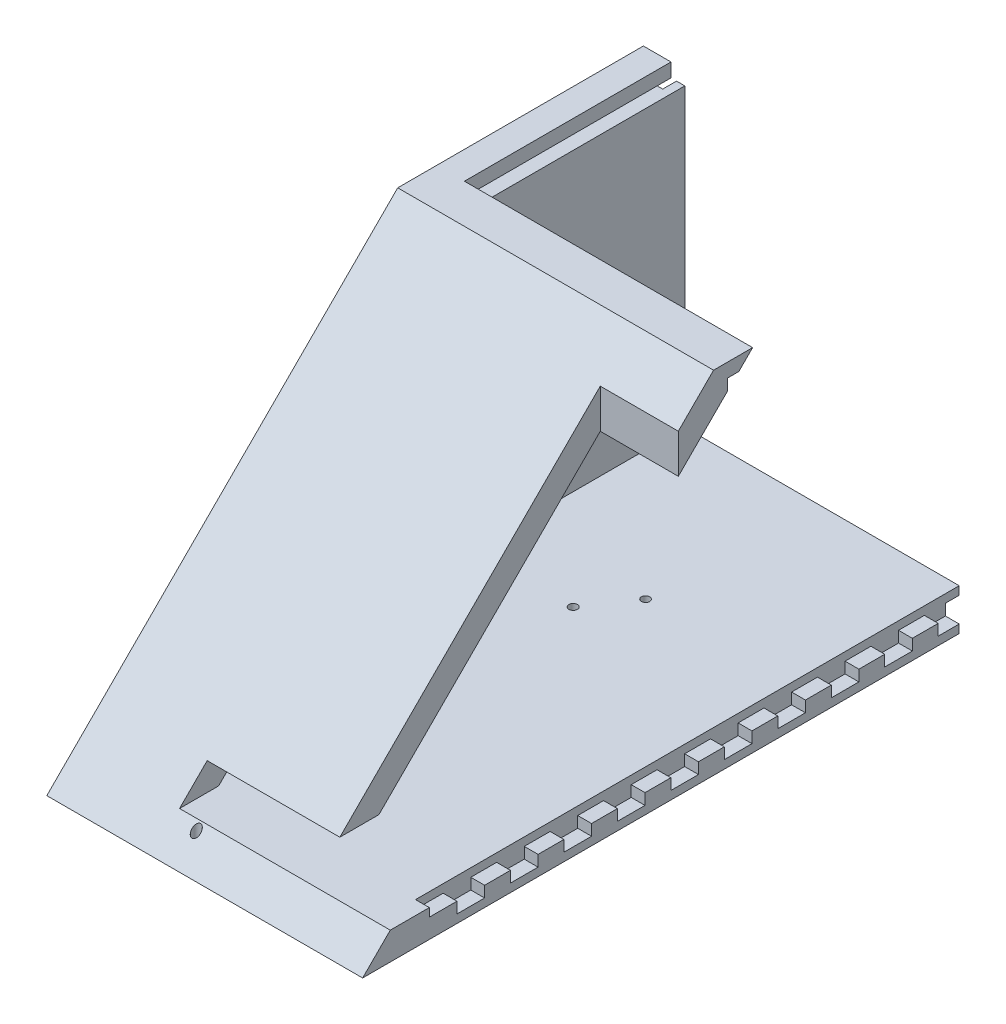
from build123d import *

# Parameters (mm, degrees)
BOSS_EXTRUDE2_DEPTH               = 114.3
SHELL2_T                          = -10
CUT_EXTRUDE2_DEPTH                = 299.8
SKETCH5_W                         = 208.6
SKETCH5_H                         = 5
CUT_EXTRUDE3_DEPTH                = 10
BASE_HOLE_W                       = 152.5
BASE_HOLE_H                       = 152
CUT_EXTRUDE5_DEPTH                = 10
SKETCH16_W                        = 56.5
SKETCH16_H                        = 56.5
CUT_EXTRUDE7_DEPTH                = 120
SKETCH17_W                        = 56.5
SKETCH17_H                        = 47.75
CUT_EXTRUDE8_DEPTH                = 120
SIDEWALL_MOTOR_TABS1_W            = 100
SIDEWALL_MOTOR_TABS1_H            = 30
MOTOR_MOUNT_WALL1_DEPTH           = 10
SIDEWALL_MOTOR_TABS2_W            = 100
SIDEWALL_MOTOR_TABS2_H            = 30
MOTOR_MOUNT_WALL2_DEPTH           = 10
CUT_EXTRUDE_REAR_SLOTS_DEPTH      = 10
CUT_EXTRUDE_FRONT_SLOTS_DEPTH     = 10
SKETCH25_R                        = 3
SKETCH25_R_2                      = 1.55
MOTOR_HOLES_DEPTH                 = 505.815015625
REFERENCE1_BASE_R                 = 1.55
CUT_EXTRUDE9_DEPTH                = 10
SKETCH26_R                        = 1.5
CUT_EXTRUDE_TOWERBASE_HOLES_DEPTH = 10
SKETCH27_W                        = 431.8
SKETCH27_H                        = 157
CUT_EXTRUDE10_DEPTH               = 465.375634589
CUT_EXTRUDE11_DEPTH               = 5
SKETCH31_W                        = 4
SKETCH31_H                        = 10
SKETCH31_W_2                      = 10
SKETCH31_H_2                      = 4
CUT_EXTRUDE12_DEPTH               = 5
SKETCH33_W                        = 114.3
SKETCH33_H                        = 157
CUT_EXTRUDE13_DEPTH               = 276.329439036
BOSS_EXTRUDE3_DEPTH               = 5
SKETCH35_W                        = 10
SKETCH35_H                        = 4
SKETCH35_W_2                      = 4
SKETCH35_H_2                      = 10
BOSS_EXTRUDE4_DEPTH               = 5


with BuildPart() as part:
    # Sketch3 → Boss-Extrude2 (new, symmetric)
    with BuildSketch(Plane(origin=(0, 0, 0), x_dir=(0, 0, -1), z_dir=(1, 0, 0))):
        Polygon((0, 0), (431.8, 0), (431.8, 127), (127, 127), align=None)
    extrude(amount=BOSS_EXTRUDE2_DEPTH, both=True)

    # Shell2
    shell2_openings = [part.faces().sort_by_distance(p)[0] for p in [
        (0, 127, -279.4),
    ]]
    offset(amount=SHELL2_T, openings=shell2_openings, kind=Kind.INTERSECTION)

    # Sketch4 → Cut-Extrude2 (cut)
    with BuildSketch(Plane(origin=(0, 0, -431.8), x_dir=(-1, 0, 0), z_dir=(0, 0, -1))):
        Polygon((-104.3, 122), (-109.3, 122), (-109.3, 117), (-104.3, 117), (104.3, 117), (109.3, 117), (109.3, 122), (104.3, 122), align=None)
    extrude(amount=-CUT_EXTRUDE2_DEPTH, mode=Mode.SUBTRACT)

    # Sketch5 → Cut-Extrude3 (cut)
    with BuildSketch(Plane(origin=(0, 0, -431.8), x_dir=(-1, 0, 0), z_dir=(0, 0, -1))):
        with Locations((0, 124.5)):
            Rectangle(SKETCH5_W, SKETCH5_H)
    extrude(amount=-CUT_EXTRUDE3_DEPTH, mode=Mode.SUBTRACT)

    # Base hole → Cut-Extrude5 (cut)
    with BuildSketch(Plane(origin=(0, 10, 0), x_dir=(1, 0, 0), z_dir=(0, 1, 0))):
        with Locations((0, 86)):
            Rectangle(BASE_HOLE_W, BASE_HOLE_H)
    extrude(amount=CUT_EXTRUDE5_DEPTH, mode=Mode.SUBTRACT)

    # Sketch16 → Cut-Extrude7 (cut)
    with BuildSketch(Plane(origin=(0, 10, 0), x_dir=(1, 0, 0), z_dir=(0, 1, 0))):
        with Locations((0, 86)):
            Rectangle(SKETCH16_W, SKETCH16_H)
    extrude(amount=CUT_EXTRUDE7_DEPTH, mode=Mode.SUBTRACT)

    # Sketch17 → Cut-Extrude8 (cut)
    with BuildSketch(Plane(origin=(0, 10, 0), x_dir=(1, 0, 0), z_dir=(0, 1, 0))):
        with Locations((0, 33.875)):
            Rectangle(SKETCH17_W, SKETCH17_H)
    extrude(amount=CUT_EXTRUDE8_DEPTH, mode=Mode.SUBTRACT)

    # Sidewall_Motor_Tabs1 → Motor_Mount_Wall1 (add)
    with BuildSketch(Plane(origin=(114.3, 0, 0), x_dir=(0, 0, -1), z_dir=(1, 0, 0))):
        Polygon((0, 0), (30, -30), (100, -30), (100, 0), align=None)
        with Locations((381.8, -15)):
            Rectangle(SIDEWALL_MOTOR_TABS1_W, SIDEWALL_MOTOR_TABS1_H)
    extrude(amount=-MOTOR_MOUNT_WALL1_DEPTH)

    # Sidewall_Motor_Tabs2 → Motor_Mount_Wall2 (add)
    with BuildSketch(Plane.ZY.offset(114.3)):
        Polygon((0, 0), (-30, -30), (-100, -30), (-100, 0), align=None)
        with Locations((-381.8, -15)):
            Rectangle(SIDEWALL_MOTOR_TABS2_W, SIDEWALL_MOTOR_TABS2_H)
    extrude(amount=-MOTOR_MOUNT_WALL2_DEPTH)

    # Rear Slots → Cut-Extrude_Rear Slots (cut)
    with BuildSketch(Plane(origin=(0, 10, 0), x_dir=(1, 0, 0), z_dir=(0, 1, 0))):
        with BuildLine():
            Line((-86.8, 331.8), (-86.8, 303.8))
            ThreePointArc((-86.8, 303.8), (-94.3, 296.3), (-101.8, 303.8))
            Line((-101.8, 303.8), (-101.8, 331.8))
            ThreePointArc((-101.8, 331.8), (-94.3, 339.3), (-86.8, 331.8))
        make_face()
        with BuildLine():
            Line((86.8, 331.8), (86.8, 303.8))
            ThreePointArc((86.8, 303.8), (94.3, 296.3), (101.8, 303.8))
            Line((101.8, 303.8), (101.8, 331.8))
            ThreePointArc((101.8, 331.8), (94.3, 339.3), (86.8, 331.8))
        make_face()
    extrude(amount=-CUT_EXTRUDE_REAR_SLOTS_DEPTH, mode=Mode.SUBTRACT)

    # Front Slots → Cut-Extrude_Front Slots (cut)
    with BuildSketch(Plane(origin=(0, 10, 0), x_dir=(1, 0, 0), z_dir=(0, 1, 0))):
        with BuildLine():
            Line((-86.8, 128), (-86.8, 100))
            ThreePointArc((-86.8, 100), (-94.3, 92.5), (-101.8, 100))
            Line((-101.8, 100), (-101.8, 128))
            ThreePointArc((-101.8, 128), (-94.3, 135.5), (-86.8, 128))
        make_face()
        with BuildLine():
            Line((86.8, 128), (86.8, 100))
            ThreePointArc((86.8, 100), (94.3, 92.5), (101.8, 100))
            Line((101.8, 100), (101.8, 128))
            ThreePointArc((101.8, 128), (94.3, 135.5), (86.8, 128))
        make_face()
    extrude(amount=-CUT_EXTRUDE_FRONT_SLOTS_DEPTH, mode=Mode.SUBTRACT)

    # Sketch25 → Motor_Holes (cut, through all)
    with BuildSketch(Plane.ZY.offset(114.3)):
        with Locations((-385.2, -15)):
            Circle(SKETCH25_R)
        with Locations((-365.1, -6.25)):
            Circle(SKETCH25_R_2)
        with Locations((-365.1, -23.75)):
            Circle(SKETCH25_R_2)
        with Locations((-66.7, -23.75)):
            Circle(SKETCH25_R_2)
        with Locations((-66.7, -6.25)):
            Circle(SKETCH25_R_2)
        with Locations((-46.6, -15)):
            Circle(SKETCH25_R)
    extrude(amount=-MOTOR_HOLES_DEPTH, mode=Mode.SUBTRACT)

    # Reference1 Base → Cut-Extrude9 (cut)
    with BuildSketch(Plane.XZ):
        with Locations(Location((-68.2, -144.4, 0), (0, 0, 270))):
            Circle(REFERENCE1_BASE_R)
        with Locations(Location((-68.2, -8, 0), (0, 0, 270))):
            Circle(REFERENCE1_BASE_R)
        with Locations(Location((68.2, -144.4, 0), (0, 0, 90))):
            Circle(REFERENCE1_BASE_R)
        with Locations(Location((68.2, -8, 0), (0, 0, 90))):
            Circle(REFERENCE1_BASE_R)
    extrude(amount=-CUT_EXTRUDE9_DEPTH, mode=Mode.SUBTRACT)

    # Sketch26 → Cut-Extrude_TowerBase_Holes (cut)
    with BuildSketch(Plane.XZ):
        with Locations(Location((-57.54, -159.94, 0), (0, 0, 270))):
            Circle(SKETCH26_R)
        with Locations(Location((57.54, -159.94, 0), (0, 0, 90))):
            Circle(SKETCH26_R)
        with Locations(Location((-57.54, -275.02, 0), (0, 0, 270))):
            Circle(SKETCH26_R)
        with Locations(Location((57.54, -275.02, 0), (0, 0, 90))):
            Circle(SKETCH26_R)
        with Locations(Location((-57.54, -285.1, 0), (0, 0, 270))):
            Circle(SKETCH26_R)
        with Locations(Location((-57.54, -400.18, 0), (0, 0, 270))):
            Circle(SKETCH26_R)
        with Locations(Location((57.54, -285.1, 0), (0, 0, 90))):
            Circle(SKETCH26_R)
        with Locations(Location((57.54, -400.18, 0), (0, 0, 90))):
            Circle(SKETCH26_R)
    extrude(amount=-CUT_EXTRUDE_TOWERBASE_HOLES_DEPTH, mode=Mode.SUBTRACT)

    # Sketch27 → Cut-Extrude10 (cut, through all)
    with BuildSketch(Plane(origin=(0, 0, 0), x_dir=(0, 0, -1), z_dir=(1, 0, 0))):
        with Locations((215.9, 48.5)):
            Rectangle(SKETCH27_W, SKETCH27_H)
    extrude(amount=CUT_EXTRUDE10_DEPTH, mode=Mode.SUBTRACT)

    # Sketch28 → Cut-Extrude11 (cut)
    with BuildSketch(Plane(origin=(0, 0, 0), x_dir=(0, 0, -1), z_dir=(1, 0, 0))):
        Polygon((24.142135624, 10), (421.8, 10), (421.8, 117), (424.8, 117), (424.8, 7), (24.142135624, 7), align=None)
    extrude(amount=-CUT_EXTRUDE11_DEPTH, mode=Mode.SUBTRACT)

    # Sketch31 → Cut-Extrude12 (cut)
    with BuildSketch(Plane(origin=(0, 0, 0), x_dir=(0, 0, -1), z_dir=(1, 0, 0))):
        with Locations((426.8, 25)):
            Rectangle(SKETCH31_W, SKETCH31_H)
        with Locations((406.8, 5)):
            Rectangle(SKETCH31_W_2, SKETCH31_H_2)
        with Locations((387.449586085, 5)):
            Rectangle(SKETCH31_W_2, SKETCH31_H_2)
        with Locations((368.099172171, 5)):
            Rectangle(SKETCH31_W_2, SKETCH31_H_2)
        with Locations((348.748758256, 5)):
            Rectangle(SKETCH31_W_2, SKETCH31_H_2)
        with Locations((329.398344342, 5)):
            Rectangle(SKETCH31_W_2, SKETCH31_H_2)
        with Locations((310.047930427, 5)):
            Rectangle(SKETCH31_W_2, SKETCH31_H_2)
        with Locations((290.697516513, 5)):
            Rectangle(SKETCH31_W_2, SKETCH31_H_2)
        with Locations((271.347102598, 5)):
            Rectangle(SKETCH31_W_2, SKETCH31_H_2)
        with Locations((251.996688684, 5)):
            Rectangle(SKETCH31_W_2, SKETCH31_H_2)
        with Locations((232.646274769, 5)):
            Rectangle(SKETCH31_W_2, SKETCH31_H_2)
        with Locations((213.295860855, 5)):
            Rectangle(SKETCH31_W_2, SKETCH31_H_2)
        with Locations((193.94544694, 5)):
            Rectangle(SKETCH31_W_2, SKETCH31_H_2)
        with Locations((174.595033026, 5)):
            Rectangle(SKETCH31_W_2, SKETCH31_H_2)
        with Locations((155.244619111, 5)):
            Rectangle(SKETCH31_W_2, SKETCH31_H_2)
        with Locations((135.894205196, 5)):
            Rectangle(SKETCH31_W_2, SKETCH31_H_2)
        with Locations((116.543791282, 5)):
            Rectangle(SKETCH31_W_2, SKETCH31_H_2)
        with Locations((97.193377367, 5)):
            Rectangle(SKETCH31_W_2, SKETCH31_H_2)
        with Locations((77.842963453, 5)):
            Rectangle(SKETCH31_W_2, SKETCH31_H_2)
        with Locations((58.492549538, 5)):
            Rectangle(SKETCH31_W_2, SKETCH31_H_2)
        with Locations((39.142135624, 5)):
            Rectangle(SKETCH31_W_2, SKETCH31_H_2)
        with Locations((426.8, 41.75)):
            Rectangle(SKETCH31_W, SKETCH31_H)
        with Locations((426.8, 58.5)):
            Rectangle(SKETCH31_W, SKETCH31_H)
        with Locations((426.8, 75.25)):
            Rectangle(SKETCH31_W, SKETCH31_H)
        with Locations((426.8, 92)):
            Rectangle(SKETCH31_W, SKETCH31_H)
    extrude(amount=-CUT_EXTRUDE12_DEPTH, mode=Mode.SUBTRACT)

    # Sketch33 → Cut-Extrude13 (cut, through all)
    with BuildSketch(Plane.XY.offset(-215.9)):
        with Locations((-57.15, 48.5)):
            Rectangle(SKETCH33_W, SKETCH33_H)
    extrude(amount=-CUT_EXTRUDE13_DEPTH, mode=Mode.SUBTRACT)

    # Sketch34 → Boss-Extrude3 (add)
    with BuildSketch(Plane(origin=(0, 0, -215.9), x_dir=(-1, 0, 0), z_dir=(0, 0, -1))):
        Polygon((5, 10), (104.3, 10), (104.3, 117), (107.3, 117), (107.3, 7), (5, 7), align=None)
    extrude(amount=BOSS_EXTRUDE3_DEPTH)

    # Sketch35 → Boss-Extrude4 (add)
    with BuildSketch(Plane(origin=(0, 0, -215.9), x_dir=(-1, 0, 0), z_dir=(0, 0, -1))):
        with Locations((89.3, 5)):
            Rectangle(SKETCH35_W, SKETCH35_H)
        with Locations((109.3, 25)):
            Rectangle(SKETCH35_W_2, SKETCH35_H_2)
        with Locations((66.2, 5)):
            Rectangle(SKETCH35_W, SKETCH35_H)
        with Locations((43.1, 5)):
            Rectangle(SKETCH35_W, SKETCH35_H)
        with Locations((20, 5)):
            Rectangle(SKETCH35_W, SKETCH35_H)
        with Locations((109.3, 44.25)):
            Rectangle(SKETCH35_W_2, SKETCH35_H_2)
        with Locations((109.3, 63.5)):
            Rectangle(SKETCH35_W_2, SKETCH35_H_2)
        with Locations((109.3, 82.75)):
            Rectangle(SKETCH35_W_2, SKETCH35_H_2)
        with Locations((109.3, 102)):
            Rectangle(SKETCH35_W_2, SKETCH35_H_2)
    extrude(amount=BOSS_EXTRUDE4_DEPTH)


solid = part.part
